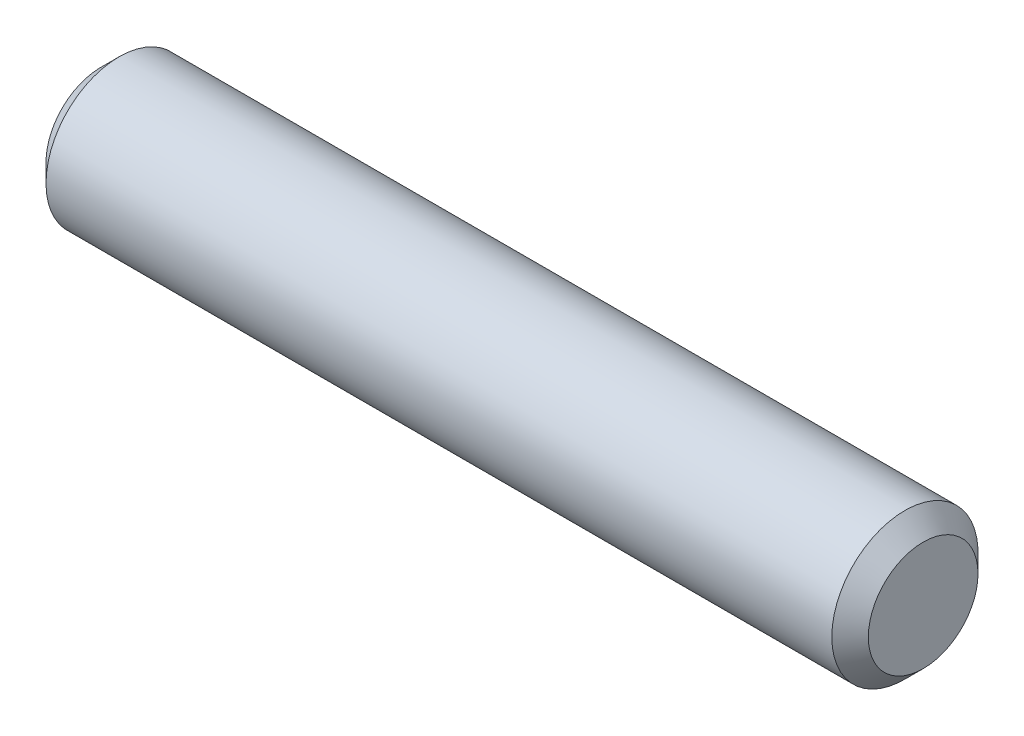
from build123d import *

# Parameters (mm, degrees)
SKETCH1_R      = 4
EXTRUDE1_DEPTH = 45
CHAMFER1_SIZE  = 1


with BuildPart() as part:
    # Sketch1 → Extrude1 (new body)
    with BuildSketch(Plane(origin=(0, 0, 0), x_dir=(0, 0, -1), z_dir=(1, 0, 0))):
        with Locations(Location((0, 0, 0), (0, 0, 180))):
            Circle(SKETCH1_R)
    extrude(amount=EXTRUDE1_DEPTH)

    # Chamfer1
    chamfer1_edges = [part.edges().sort_by_distance(p)[0] for p in [
        (0, 0, -4),
        (45, 0, -4),
    ]]
    chamfer(chamfer1_edges, length=CHAMFER1_SIZE)


solid = part.part
